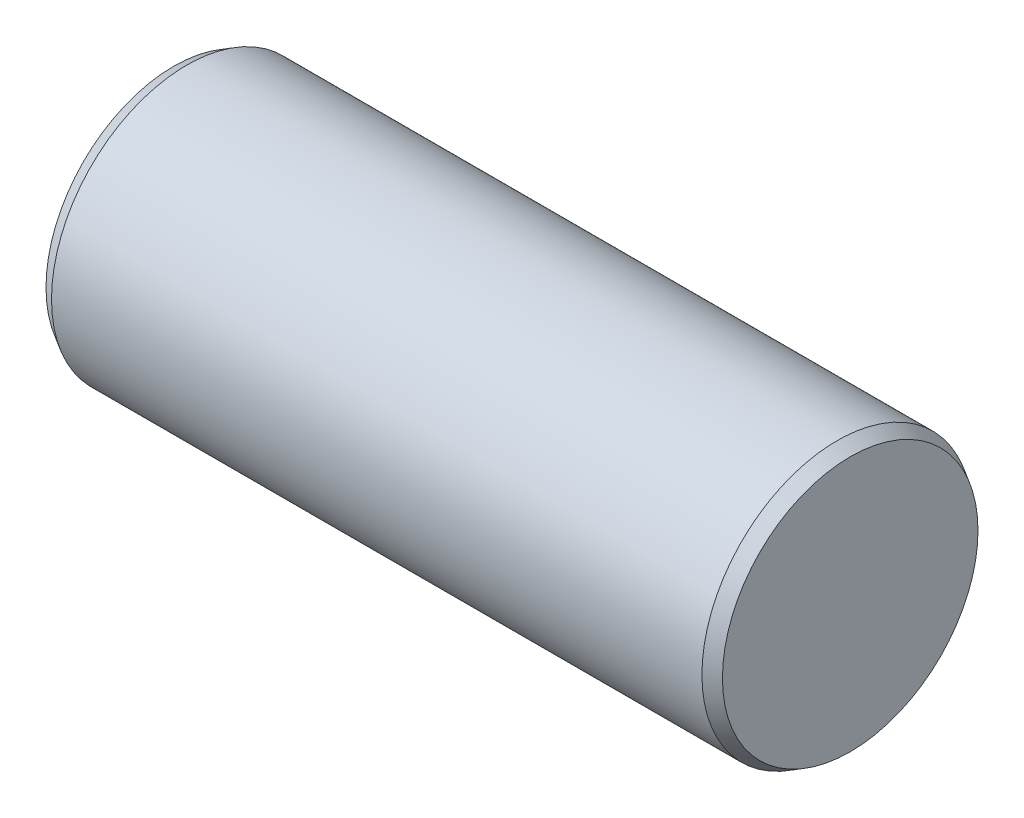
ISO-10303-21;
HEADER;
FILE_DESCRIPTION(('STEP AP214'),'2;1');
FILE_NAME('part.step','',(''),(''),'','','');
FILE_SCHEMA(('AUTOMOTIVE_DESIGN { 1 0 10303 214 1 1 1 1 }'));
ENDSEC;
DATA;
#1=APPLICATION_CONTEXT('core data for automotive mechanical design processes');
#2=APPLICATION_PROTOCOL_DEFINITION('international standard','automotive_design',2000,#1);
#3=PRODUCT_CONTEXT('',#1,'mechanical');
#4=PRODUCT('Part','Part','',(#3));
#5=PRODUCT_RELATED_PRODUCT_CATEGORY('part','',(#4));
#6=PRODUCT_DEFINITION_FORMATION('','',#4);
#7=PRODUCT_DEFINITION_CONTEXT('part definition',#1,'design');
#8=PRODUCT_DEFINITION('design','',#6,#7);
#9=PRODUCT_DEFINITION_SHAPE('','',#8);
#10=(LENGTH_UNIT() NAMED_UNIT(*) SI_UNIT(.MILLI.,.METRE.));
#11=(NAMED_UNIT(*) PLANE_ANGLE_UNIT() SI_UNIT($,.RADIAN.));
#12=(NAMED_UNIT(*) SI_UNIT($,.STERADIAN.) SOLID_ANGLE_UNIT());
#13=UNCERTAINTY_MEASURE_WITH_UNIT(LENGTH_MEASURE(1.E-05),#10,'distance_accuracy_value','');
#14=(GEOMETRIC_REPRESENTATION_CONTEXT(3) GLOBAL_UNCERTAINTY_ASSIGNED_CONTEXT((#13)) GLOBAL_UNIT_ASSIGNED_CONTEXT((#10,
#11,#12)) REPRESENTATION_CONTEXT('',''));
#15=CARTESIAN_POINT('',(0.,0.,0.));
#16=DIRECTION('',(0.,0.,1.));
#17=DIRECTION('',(1.,0.,0.));
#18=AXIS2_PLACEMENT_3D('',#15,#16,#17);
#19=CARTESIAN_POINT('',(22.5,0.,0.));
#20=DIRECTION('',(-1.,0.,0.));
#21=DIRECTION('',(0.,0.,1.));
#22=AXIS2_PLACEMENT_3D('',#19,#20,#21);
#23=CYLINDRICAL_SURFACE('',#22,9.);
#24=CARTESIAN_POINT('',(21.6339745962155,0.,0.));
#25=DIRECTION('',(1.,0.,0.));
#26=DIRECTION('',(0.,0.,-1.));
#27=AXIS2_PLACEMENT_3D('',#24,#25,#26);
#28=CIRCLE('',#27,9.);
#29=CARTESIAN_POINT('',(21.6339745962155,0.,9.));
#30=VERTEX_POINT('',#29);
#31=EDGE_CURVE('E36',#30,#30,#28,.F.);
#32=CARTESIAN_POINT('',(-21.6339745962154,0.,0.));
#33=DIRECTION('',(1.,0.,0.));
#34=DIRECTION('',(0.,0.,-1.));
#35=AXIS2_PLACEMENT_3D('',#32,#33,#34);
#36=CIRCLE('',#35,9.);
#37=CARTESIAN_POINT('',(-21.6339745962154,0.,9.));
#38=VERTEX_POINT('',#37);
#39=EDGE_CURVE('E40',#38,#38,#36,.T.);
#40=CARTESIAN_POINT('',(21.6339745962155,0.,9.));
#41=CARTESIAN_POINT('',(21.1832667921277,0.,9.));
#42=CARTESIAN_POINT('',(20.7325589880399,0.,9.));
#43=CARTESIAN_POINT('',(19.8311433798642,0.,9.));
#44=CARTESIAN_POINT('',(19.3804355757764,0.,9.));
#45=CARTESIAN_POINT('',(18.4790199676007,0.,9.));
#46=CARTESIAN_POINT('',(18.0283121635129,0.,9.));
#47=CARTESIAN_POINT('',(17.1268965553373,0.,9.));
#48=CARTESIAN_POINT('',(16.6761887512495,0.,9.));
#49=CARTESIAN_POINT('',(15.7747731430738,0.,9.));
#50=CARTESIAN_POINT('',(15.324065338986,0.,9.));
#51=CARTESIAN_POINT('',(14.4226497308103,0.,9.));
#52=CARTESIAN_POINT('',(13.9719419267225,0.,9.));
#53=CARTESIAN_POINT('',(13.0705263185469,0.,9.));
#54=CARTESIAN_POINT('',(12.6198185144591,0.,9.));
#55=CARTESIAN_POINT('',(11.7184029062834,0.,9.));
#56=CARTESIAN_POINT('',(11.2676951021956,0.,9.));
#57=CARTESIAN_POINT('',(10.3662794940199,0.,9.));
#58=CARTESIAN_POINT('',(9.91557168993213,0.,9.));
#59=CARTESIAN_POINT('',(9.01415608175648,0.,9.));
#60=CARTESIAN_POINT('',(8.56344827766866,0.,9.));
#61=CARTESIAN_POINT('',(7.66203266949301,0.,9.));
#62=CARTESIAN_POINT('',(7.21132486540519,0.,9.));
#63=CARTESIAN_POINT('',(6.30990925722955,0.,9.));
#64=CARTESIAN_POINT('',(5.85920145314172,0.,9.));
#65=CARTESIAN_POINT('',(4.95778584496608,0.,9.));
#66=CARTESIAN_POINT('',(4.50707804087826,0.,9.));
#67=CARTESIAN_POINT('',(3.60566243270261,0.,9.));
#68=CARTESIAN_POINT('',(3.15495462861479,0.,9.));
#69=CARTESIAN_POINT('',(2.25353902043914,0.,9.));
#70=CARTESIAN_POINT('',(1.80283121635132,0.,9.));
#71=CARTESIAN_POINT('',(0.901415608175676,0.,9.));
#72=CARTESIAN_POINT('',(0.450707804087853,0.,9.));
#73=CARTESIAN_POINT('',(-0.450707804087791,0.,9.));
#74=CARTESIAN_POINT('',(-0.901415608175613,0.,9.));
#75=CARTESIAN_POINT('',(-1.80283121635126,0.,9.));
#76=CARTESIAN_POINT('',(-2.25353902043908,0.,9.));
#77=CARTESIAN_POINT('',(-3.15495462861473,0.,9.));
#78=CARTESIAN_POINT('',(-3.60566243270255,0.,9.));
#79=CARTESIAN_POINT('',(-4.50707804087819,0.,9.));
#80=CARTESIAN_POINT('',(-4.95778584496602,0.,9.));
#81=CARTESIAN_POINT('',(-5.85920145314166,0.,9.));
#82=CARTESIAN_POINT('',(-6.30990925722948,0.,9.));
#83=CARTESIAN_POINT('',(-7.21132486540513,0.,9.));
#84=CARTESIAN_POINT('',(-7.66203266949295,0.,9.));
#85=CARTESIAN_POINT('',(-8.56344827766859,0.,9.));
#86=CARTESIAN_POINT('',(-9.01415608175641,0.,9.));
#87=CARTESIAN_POINT('',(-9.91557168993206,0.,9.));
#88=CARTESIAN_POINT('',(-10.3662794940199,0.,9.));
#89=CARTESIAN_POINT('',(-11.2676951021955,0.,9.));
#90=CARTESIAN_POINT('',(-11.7184029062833,0.,9.));
#91=CARTESIAN_POINT('',(-12.619818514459,0.,9.));
#92=CARTESIAN_POINT('',(-13.0705263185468,0.,9.));
#93=CARTESIAN_POINT('',(-13.9719419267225,0.,9.));
#94=CARTESIAN_POINT('',(-14.4226497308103,0.,9.));
#95=CARTESIAN_POINT('',(-15.3240653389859,0.,9.));
#96=CARTESIAN_POINT('',(-15.7747731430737,0.,9.));
#97=CARTESIAN_POINT('',(-16.6761887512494,0.,9.));
#98=CARTESIAN_POINT('',(-17.1268965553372,0.,9.));
#99=CARTESIAN_POINT('',(-18.0283121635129,0.,9.));
#100=CARTESIAN_POINT('',(-18.4790199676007,0.,9.));
#101=CARTESIAN_POINT('',(-19.3804355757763,0.,9.));
#102=CARTESIAN_POINT('',(-19.8311433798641,0.,9.));
#103=CARTESIAN_POINT('',(-20.7325589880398,0.,9.));
#104=CARTESIAN_POINT('',(-21.1832667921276,0.,9.));
#105=CARTESIAN_POINT('',(-21.6339745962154,0.,9.));
#106=B_SPLINE_CURVE_WITH_KNOTS('',3,(#40,#41,#42,#43,#44,#45,#46,#47,#48,#49,#50,#51,#52,#53,
#54,#55,#56,#57,#58,#59,#60,#61,#62,#63,#64,#65,#66,#67,#68,#69,#70,#71,#72,#73,#74,#75,#76,#77,
#78,#79,#80,#81,#82,#83,#84,#85,#86,#87,#88,#89,#90,#91,#92,#93,#94,#95,#96,#97,#98,#99,#100,
#101,#102,#103,#104,#105),.UNSPECIFIED.,.F.,.F.,(4,2,2,2,2,2,2,2,2,2,2,2,2,2,2,2,2,2,2,2,2,2,2,
2,2,2,2,2,2,2,2,2,4),(0.,1.35212341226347,2.70424682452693,4.0563702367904,5.40849364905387,
6.76061706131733,8.1127404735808,9.46486388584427,10.8169872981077,12.1691107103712,
13.5212341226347,14.8733575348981,16.2254809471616,17.5776043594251,18.9297277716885,
20.281851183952,21.6339745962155,22.9860980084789,24.3382214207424,25.6903448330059,
27.0424682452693,28.3945916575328,29.7467150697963,31.0988384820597,32.4509618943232,
33.8030853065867,35.1552087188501,36.5073321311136,37.8594555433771,39.2115789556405,
40.563702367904,41.9158257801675,43.2679491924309),.UNSPECIFIED.);
#107=EDGE_CURVE('BSEAM29',#30,#38,#106,.T.);
#108=ORIENTED_EDGE('',*,*,#31,.T.);
#109=ORIENTED_EDGE('',*,*,#39,.T.);
#110=ORIENTED_EDGE('',*,*,#107,.T.);
#111=ORIENTED_EDGE('',*,*,#107,.F.);
#112=EDGE_LOOP('',(#108,#110,#109,#111));
#113=FACE_BOUND('',#112,.T.);
#114=ADVANCED_FACE('F29',(#113),#23,.T.);
#115=CARTESIAN_POINT('',(22.5,0.,0.));
#116=DIRECTION('',(1.,0.,0.));
#117=DIRECTION('',(0.,0.,-1.));
#118=AXIS2_PLACEMENT_3D('',#115,#116,#117);
#119=PLANE('',#118);
#120=CARTESIAN_POINT('',(22.5,0.,0.));
#121=DIRECTION('',(1.,0.,0.));
#122=DIRECTION('',(0.,0.,-1.));
#123=AXIS2_PLACEMENT_3D('',#120,#121,#122);
#124=CIRCLE('',#123,8.49999999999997);
#125=CARTESIAN_POINT('',(22.5,0.,8.49999999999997));
#126=VERTEX_POINT('',#125);
#127=EDGE_CURVE('E44',#126,#126,#124,.T.);
#128=ORIENTED_EDGE('',*,*,#127,.T.);
#129=EDGE_LOOP('',(#128));
#130=FACE_BOUND('',#129,.T.);
#131=ADVANCED_FACE('F50',(#130),#119,.T.);
#132=CARTESIAN_POINT('',(-22.5,0.,0.));
#133=DIRECTION('',(1.,0.,0.));
#134=DIRECTION('',(0.,0.,-1.));
#135=AXIS2_PLACEMENT_3D('',#132,#133,#134);
#136=PLANE('',#135);
#137=CARTESIAN_POINT('',(-22.5,0.,0.));
#138=DIRECTION('',(1.,0.,0.));
#139=DIRECTION('',(0.,0.,-1.));
#140=AXIS2_PLACEMENT_3D('',#137,#138,#139);
#141=CIRCLE('',#140,8.49999999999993);
#142=CARTESIAN_POINT('',(-22.5,0.,-8.49999999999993));
#143=VERTEX_POINT('',#142);
#144=EDGE_CURVE('E10',#143,#143,#141,.F.);
#145=ORIENTED_EDGE('',*,*,#144,.T.);
#146=EDGE_LOOP('',(#145));
#147=FACE_BOUND('',#146,.T.);
#148=ADVANCED_FACE('F54',(#147),#136,.F.);
#149=CARTESIAN_POINT('',(22.5,0.,0.));
#150=DIRECTION('',(-1.,0.,0.));
#151=DIRECTION('',(0.,0.,1.));
#152=AXIS2_PLACEMENT_3D('',#149,#150,#151);
#153=CONICAL_SURFACE('',#152,8.49999999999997,0.5235987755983);
#154=CARTESIAN_POINT('',(21.6339745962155,0.,9.));
#155=CARTESIAN_POINT('',(21.6429956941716,0.,8.99479166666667));
#156=CARTESIAN_POINT('',(21.6520167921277,0.,8.98958333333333));
#157=CARTESIAN_POINT('',(21.6700589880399,0.,8.97916666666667));
#158=CARTESIAN_POINT('',(21.6790800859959,0.,8.97395833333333));
#159=CARTESIAN_POINT('',(21.6971222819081,0.,8.96354166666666));
#160=CARTESIAN_POINT('',(21.7061433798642,0.,8.95833333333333));
#161=CARTESIAN_POINT('',(21.7241855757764,0.,8.94791666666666));
#162=CARTESIAN_POINT('',(21.7332066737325,0.,8.94270833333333));
#163=CARTESIAN_POINT('',(21.7512488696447,0.,8.93229166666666));
#164=CARTESIAN_POINT('',(21.7602699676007,0.,8.92708333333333));
#165=CARTESIAN_POINT('',(21.7783121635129,0.,8.91666666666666));
#166=CARTESIAN_POINT('',(21.787333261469,0.,8.91145833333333));
#167=CARTESIAN_POINT('',(21.8053754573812,0.,8.90104166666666));
#168=CARTESIAN_POINT('',(21.8143965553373,0.,8.89583333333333));
#169=CARTESIAN_POINT('',(21.8324387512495,0.,8.88541666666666));
#170=CARTESIAN_POINT('',(21.8414598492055,0.,8.88020833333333));
#171=CARTESIAN_POINT('',(21.8595020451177,0.,8.86979166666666));
#172=CARTESIAN_POINT('',(21.8685231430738,0.,8.86458333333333));
#173=CARTESIAN_POINT('',(21.886565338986,0.,8.85416666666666));
#174=CARTESIAN_POINT('',(21.8955864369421,0.,8.84895833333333));
#175=CARTESIAN_POINT('',(21.9136286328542,0.,8.83854166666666));
#176=CARTESIAN_POINT('',(21.9226497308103,0.,8.83333333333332));
#177=CARTESIAN_POINT('',(21.9406919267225,0.,8.82291666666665));
#178=CARTESIAN_POINT('',(21.9497130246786,0.,8.81770833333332));
#179=CARTESIAN_POINT('',(21.9677552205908,0.,8.80729166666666));
#180=CARTESIAN_POINT('',(21.9767763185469,0.,8.80208333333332));
#181=CARTESIAN_POINT('',(21.994818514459,0.,8.79166666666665));
#182=CARTESIAN_POINT('',(22.0038396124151,0.,8.78645833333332));
#183=CARTESIAN_POINT('',(22.0218818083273,0.,8.77604166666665));
#184=CARTESIAN_POINT('',(22.0309029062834,0.,8.77083333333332));
#185=CARTESIAN_POINT('',(22.0489451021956,0.,8.76041666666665));
#186=CARTESIAN_POINT('',(22.0579662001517,0.,8.75520833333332));
#187=CARTESIAN_POINT('',(22.0760083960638,0.,8.74479166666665));
#188=CARTESIAN_POINT('',(22.0850294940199,0.,8.73958333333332));
#189=CARTESIAN_POINT('',(22.1030716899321,0.,8.72916666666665));
#190=CARTESIAN_POINT('',(22.1120927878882,0.,8.72395833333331));
#191=CARTESIAN_POINT('',(22.1301349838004,0.,8.71354166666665));
#192=CARTESIAN_POINT('',(22.1391560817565,0.,8.70833333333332));
#193=CARTESIAN_POINT('',(22.1571982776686,0.,8.69791666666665));
#194=CARTESIAN_POINT('',(22.1662193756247,0.,8.69270833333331));
#195=CARTESIAN_POINT('',(22.1842615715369,0.,8.68229166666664));
#196=CARTESIAN_POINT('',(22.193282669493,0.,8.67708333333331));
#197=CARTESIAN_POINT('',(22.2113248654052,0.,8.66666666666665));
#198=CARTESIAN_POINT('',(22.2203459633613,0.,8.66145833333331));
#199=CARTESIAN_POINT('',(22.2383881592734,0.,8.65104166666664));
#200=CARTESIAN_POINT('',(22.2474092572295,0.,8.64583333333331));
#201=CARTESIAN_POINT('',(22.2654514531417,0.,8.63541666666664));
#202=CARTESIAN_POINT('',(22.2744725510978,0.,8.63020833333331));
#203=CARTESIAN_POINT('',(22.29251474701,0.,8.61979166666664));
#204=CARTESIAN_POINT('',(22.3015358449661,0.,8.61458333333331));
#205=CARTESIAN_POINT('',(22.3195780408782,0.,8.60416666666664));
#206=CARTESIAN_POINT('',(22.3285991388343,0.,8.59895833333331));
#207=CARTESIAN_POINT('',(22.3466413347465,0.,8.58854166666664));
#208=CARTESIAN_POINT('',(22.3556624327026,0.,8.58333333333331));
#209=CARTESIAN_POINT('',(22.3737046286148,0.,8.57291666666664));
#210=CARTESIAN_POINT('',(22.3827257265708,0.,8.56770833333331));
#211=CARTESIAN_POINT('',(22.400767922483,0.,8.55729166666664));
#212=CARTESIAN_POINT('',(22.4097890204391,0.,8.5520833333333));
#213=CARTESIAN_POINT('',(22.4278312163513,0.,8.54166666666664));
#214=CARTESIAN_POINT('',(22.4368523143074,0.,8.53645833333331));
#215=CARTESIAN_POINT('',(22.4548945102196,0.,8.52604166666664));
#216=CARTESIAN_POINT('',(22.4639156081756,0.,8.5208333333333));
#217=CARTESIAN_POINT('',(22.4819578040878,0.,8.51041666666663));
#218=CARTESIAN_POINT('',(22.4909789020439,0.,8.5052083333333));
#219=CARTESIAN_POINT('',(22.5,0.,8.49999999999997));
#220=B_SPLINE_CURVE_WITH_KNOTS('',3,(#154,#155,#156,#157,#158,#159,#160,#161,#162,#163,#164,
#165,#166,#167,#168,#169,#170,#171,#172,#173,#174,#175,#176,#177,#178,#179,#180,#181,#182,#183,
#184,#185,#186,#187,#188,#189,#190,#191,#192,#193,#194,#195,#196,#197,#198,#199,#200,#201,#202,
#203,#204,#205,#206,#207,#208,#209,#210,#211,#212,#213,#214,#215,#216,#217,#218,#219),
.UNSPECIFIED.,.F.,.F.,(4,2,2,2,2,2,2,2,2,2,2,2,2,2,2,2,2,2,2,2,2,2,2,2,2,2,2,2,2,2,2,2,4),(0.,
0.031250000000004,0.0625000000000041,0.0937500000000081,0.125000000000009,0.156250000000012,
0.187500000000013,0.218750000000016,0.250000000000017,0.281250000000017,0.312500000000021,
0.343750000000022,0.375000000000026,0.406250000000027,0.43750000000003,0.468750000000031,
0.500000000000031,0.531250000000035,0.562500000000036,0.593750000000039,0.62500000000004,
0.656250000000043,0.687500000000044,0.718750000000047,0.750000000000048,0.781250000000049,
0.812500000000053,0.843750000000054,0.875000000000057,0.906250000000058,0.937500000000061,
0.968750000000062,1.00000000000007),.UNSPECIFIED.);
#221=EDGE_CURVE('BSEAM52',#30,#126,#220,.T.);
#222=ORIENTED_EDGE('',*,*,#31,.F.);
#223=ORIENTED_EDGE('',*,*,#127,.F.);
#224=ORIENTED_EDGE('',*,*,#221,.T.);
#225=ORIENTED_EDGE('',*,*,#221,.F.);
#226=EDGE_LOOP('',(#222,#224,#223,#225));
#227=FACE_BOUND('',#226,.T.);
#228=ADVANCED_FACE('F52',(#227),#153,.T.);
#229=CARTESIAN_POINT('',(-21.6339745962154,0.,0.));
#230=DIRECTION('',(1.,0.,0.));
#231=DIRECTION('',(0.,0.,-1.));
#232=AXIS2_PLACEMENT_3D('',#229,#230,#231);
#233=CONICAL_SURFACE('',#232,9.,0.523598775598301);
#234=ORIENTED_EDGE('',*,*,#144,.F.);
#235=EDGE_LOOP('',(#234));
#236=FACE_BOUND('',#235,.T.);
#237=ORIENTED_EDGE('',*,*,#39,.F.);
#238=EDGE_LOOP('',(#237));
#239=FACE_BOUND('',#238,.T.);
#240=ADVANCED_FACE('F31',(#236,#239),#233,.T.);
#241=CLOSED_SHELL('',(#114,#131,#148,#228,#240));
#242=MANIFOLD_SOLID_BREP('B2',#241);
#243=ADVANCED_BREP_SHAPE_REPRESENTATION('',(#18,#242),#14);
#244=SHAPE_DEFINITION_REPRESENTATION(#9,#243);
ENDSEC;
END-ISO-10303-21;
